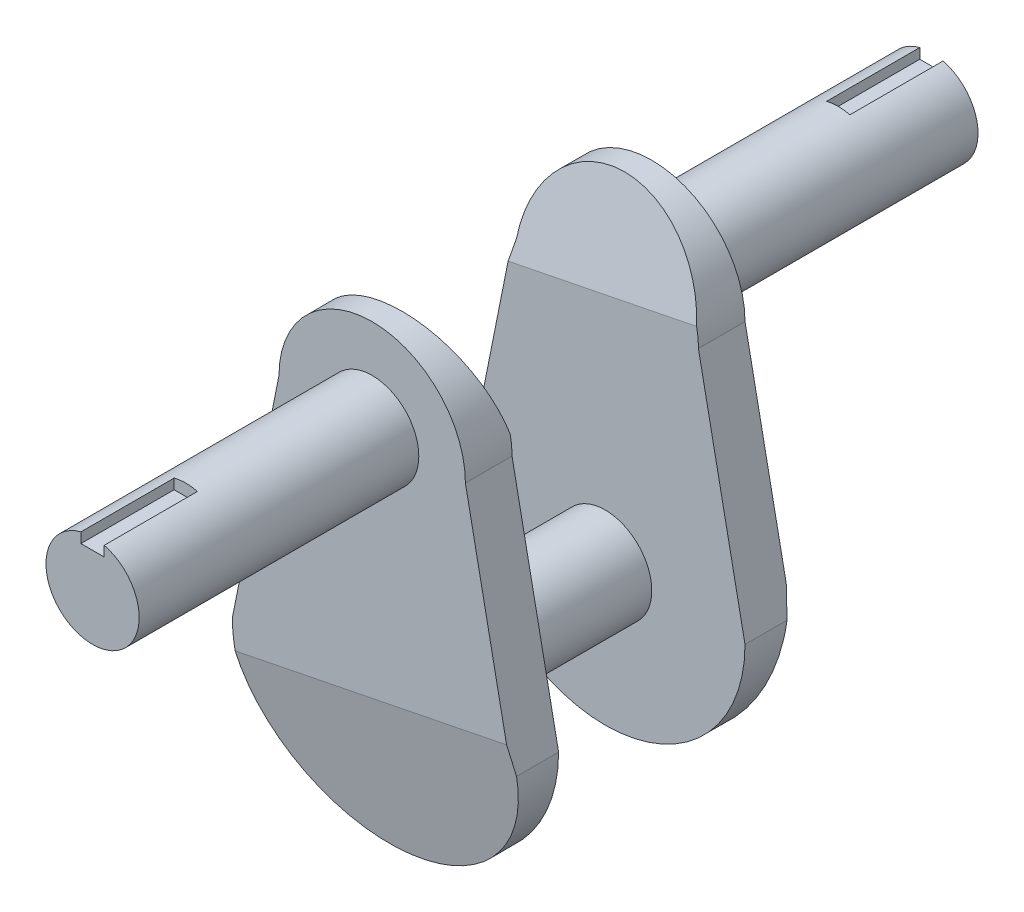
from build123d import *

# Parameters (mm, degrees)
SKETCH1_R               = 12.7
BOSS_EXTRUDE1_DEPTH     = 25.4
BOSS_EXTRUDE2_DEPTH     = 12.7
SKETCH5_R               = 12.7
BOSS_EXTRUDE3_DEPTH     = 76.2
CUT_EXTRUDE1_DEPTH      = 160.072057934
CUT_EXTRUDE3_DEPTH      = 160.072057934
CUT_EXTRUDE3_DEPTH_BACK = 160.072057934
BOSS_EXTRUDE4_START     = 25.4
SKETCH12_R              = 12.7
BOSS_EXTRUDE4_DEPTH     = 25.4
BOSS_EXTRUDE6_START     = 12.7
BOSS_EXTRUDE6_DEPTH     = 12.7
BOSS_EXTRUDE7_START     = 76.2
SKETCH14_R              = 12.7
BOSS_EXTRUDE7_DEPTH     = 76.2
CUT_EXTRUDE4_DEPTH      = 160.072057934
CUT_EXTRUDE4_DEPTH_BACK = 160.072057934
CUT_EXTRUDE5_DEPTH      = 160.072057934
CUT_EXTRUDE5_DEPTH_BACK = 160.072057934
SKETCH17_W              = 6.35
SKETCH17_H              = 6.35
CUT_EXTRUDE6_DEPTH      = 25.4
SKETCH18_W              = 6.35
SKETCH18_H              = 6.35
CUT_EXTRUDE7_DEPTH      = 25.4


with BuildPart() as part:
    # Sketch1 → Boss-Extrude1 (new body)
    with BuildSketch(Plane.XY):
        Circle(SKETCH1_R)
    extrude(amount=BOSS_EXTRUDE1_DEPTH)

    # Sketch3 → Boss-Extrude2 (add)
    with BuildSketch(Plane.XY.offset(25.4)):
        with BuildLine():
            Line((-25.4, 63.5), (-38.1, 0))
            ThreePointArc((-38.1, 0), (0, -38.1), (38.1, 0))
            Line((38.1, 0), (25.4, 63.5))
            ThreePointArc((25.4, 63.5), (0, 88.9), (-25.4, 63.5))
        make_face()
    extrude(amount=BOSS_EXTRUDE2_DEPTH)

    # Sketch5 → Boss-Extrude3 (add)
    with BuildSketch(Plane.XY.offset(38.1)):
        with Locations(Location((0, 63.5, 0), (0, 0, 180))):
            Circle(SKETCH5_R)
    extrude(amount=BOSS_EXTRUDE3_DEPTH)

    # Sketch7 → Cut-Extrude1 (cut, through all)
    with BuildSketch(Plane(origin=(36.634615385, 7.326923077, 0), x_dir=(0, 0, -1), z_dir=(0.9805806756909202, 0.1961161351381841, 0))):
        with BuildLine():
            Line((-38.1, 0), (-31.75, -38.1))
            ThreePointArc((-31.75, -38.1), (-53.975, -22.225), (-38.1, 0))
        make_face()
    extrude(amount=-CUT_EXTRUDE1_DEPTH, mode=Mode.SUBTRACT)

    # Sketch8 → Cut-Extrude3 (cut, two sides: drawn at the far end of the back side and taken through both)
    with BuildSketch(Plane(origin=(36.634615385, 7.326923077, 0), x_dir=(0, 0, -1), z_dir=(0.9805806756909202, 0.1961161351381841, 0)).offset(-CUT_EXTRUDE3_DEPTH_BACK)):
        with BuildLine():
            Line((-31.75, 87.666872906), (-25.4, 62.266872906))
            ThreePointArc((-25.4, 62.266872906), (-15.875, 78.141872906), (-31.75, 87.666872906))
        make_face()
    extrude(amount=CUT_EXTRUDE3_DEPTH + CUT_EXTRUDE3_DEPTH_BACK, mode=Mode.SUBTRACT)

    # Sketch12 → Boss-Extrude4 (add)
    with BuildSketch(Plane(origin=(0, 0, 0), x_dir=(-1, 0, 0), z_dir=(0, 0, -1)).offset(BOSS_EXTRUDE4_START)):
        Circle(SKETCH12_R)
    extrude(amount=-BOSS_EXTRUDE4_DEPTH)

    # Sketch13 → Boss-Extrude6 (add)
    with BuildSketch(Plane(origin=(0, 0, -25.4), x_dir=(-1, 0, 0), z_dir=(0, 0, -1)).offset(BOSS_EXTRUDE6_START)):
        with BuildLine():
            Line((-25.4, 63.5), (-38.1, 0))
            ThreePointArc((-38.1, 0), (0, -38.1), (38.1, 0))
            Line((38.1, 0), (25.4, 63.5))
            ThreePointArc((25.4, 63.5), (0, 88.9), (-25.4, 63.5))
        make_face()
    extrude(amount=-BOSS_EXTRUDE6_DEPTH)

    # Sketch14 → Boss-Extrude7 (add)
    with BuildSketch(Plane(origin=(0, 0, -38.1), x_dir=(-1, 0, 0), z_dir=(0, 0, -1)).offset(BOSS_EXTRUDE7_START)):
        with Locations((0, 63.5)):
            Circle(SKETCH14_R)
    extrude(amount=-BOSS_EXTRUDE7_DEPTH)

    # Sketch15 → Cut-Extrude4 (cut, two sides: drawn at the far end of the back side and taken through both)
    with BuildSketch(Plane(origin=(36.634615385, 7.326923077, 0), x_dir=(0, 0, -1), z_dir=(0.9805806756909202, 0.1961161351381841, 0)).offset(-CUT_EXTRUDE4_DEPTH_BACK)):
        with BuildLine():
            Line((38.1, 0), (31.75, -38.1))
            ThreePointArc((31.75, -38.1), (53.975, -22.225), (38.1, 0))
        make_face()
    extrude(amount=CUT_EXTRUDE4_DEPTH + CUT_EXTRUDE4_DEPTH_BACK, mode=Mode.SUBTRACT)

    # Sketch16 → Cut-Extrude5 (cut, two sides: drawn at the far end of the back side and taken through both)
    with BuildSketch(Plane(origin=(36.634615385, 7.326923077, 0), x_dir=(0, 0, -1), z_dir=(0.9805806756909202, 0.1961161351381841, 0)).offset(-CUT_EXTRUDE5_DEPTH_BACK)):
        with BuildLine():
            Line((31.75, 87.666872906), (25.4, 62.266872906))
            ThreePointArc((25.4, 62.266872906), (15.875, 78.141872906), (31.75, 87.666872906))
        make_face()
    extrude(amount=CUT_EXTRUDE5_DEPTH + CUT_EXTRUDE5_DEPTH_BACK, mode=Mode.SUBTRACT)

    # Sketch17 → Cut-Extrude6 (cut)
    with BuildSketch(Plane(origin=(0, 0, -114.3), x_dir=(-1, 0, 0), z_dir=(0, 0, -1))):
        with Locations((0, 76.2)):
            Rectangle(SKETCH17_W, SKETCH17_H)
    extrude(amount=-CUT_EXTRUDE6_DEPTH, mode=Mode.SUBTRACT)

    # Sketch18 → Cut-Extrude7 (cut)
    with BuildSketch(Plane.XY.offset(114.3)):
        with Locations((0, 76.2)):
            Rectangle(SKETCH18_W, SKETCH18_H)
    extrude(amount=-CUT_EXTRUDE7_DEPTH, mode=Mode.SUBTRACT)


solid = part.part
